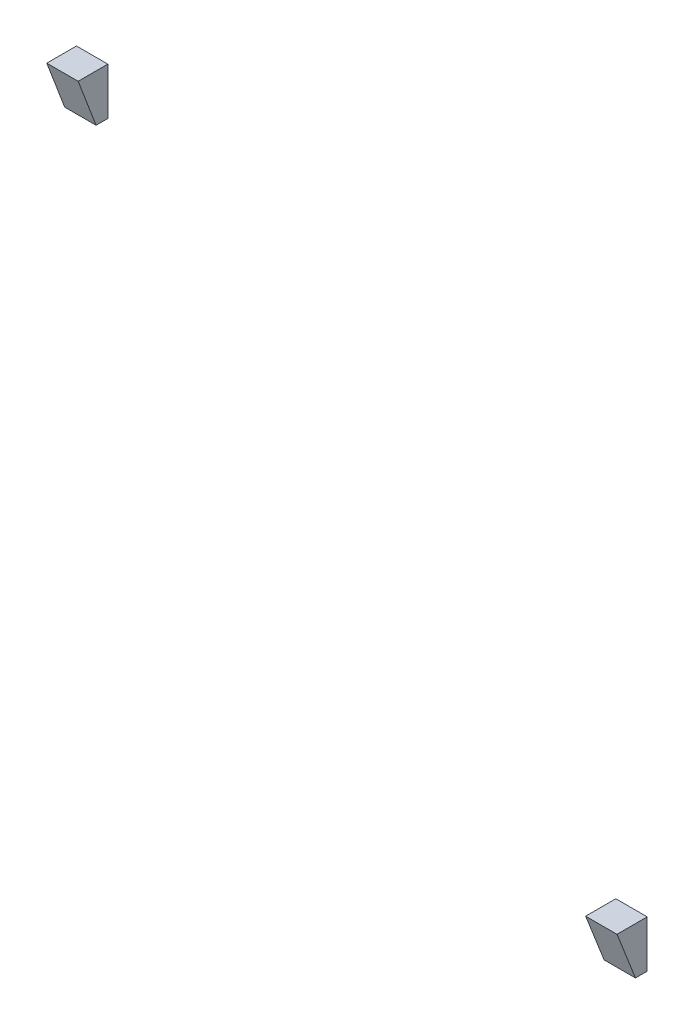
ISO-10303-21;
HEADER;
FILE_DESCRIPTION(('STEP AP214'),'2;1');
FILE_NAME('part.step','',(''),(''),'','','');
FILE_SCHEMA(('AUTOMOTIVE_DESIGN { 1 0 10303 214 1 1 1 1 }'));
ENDSEC;
DATA;
#1=APPLICATION_CONTEXT('core data for automotive mechanical design processes');
#2=APPLICATION_PROTOCOL_DEFINITION('international standard','automotive_design',2000,#1);
#3=PRODUCT_CONTEXT('',#1,'mechanical');
#4=PRODUCT('Part','Part','',(#3));
#5=PRODUCT_RELATED_PRODUCT_CATEGORY('part','',(#4));
#6=PRODUCT_DEFINITION_FORMATION('','',#4);
#7=PRODUCT_DEFINITION_CONTEXT('part definition',#1,'design');
#8=PRODUCT_DEFINITION('design','',#6,#7);
#9=PRODUCT_DEFINITION_SHAPE('','',#8);
#10=(LENGTH_UNIT() NAMED_UNIT(*) SI_UNIT(.MILLI.,.METRE.));
#11=(NAMED_UNIT(*) PLANE_ANGLE_UNIT() SI_UNIT($,.RADIAN.));
#12=(NAMED_UNIT(*) SI_UNIT($,.STERADIAN.) SOLID_ANGLE_UNIT());
#13=UNCERTAINTY_MEASURE_WITH_UNIT(LENGTH_MEASURE(1.E-05),#10,'distance_accuracy_value','');
#14=(GEOMETRIC_REPRESENTATION_CONTEXT(3) GLOBAL_UNCERTAINTY_ASSIGNED_CONTEXT((#13)) GLOBAL_UNIT_ASSIGNED_CONTEXT((#10,
#11,#12)) REPRESENTATION_CONTEXT('',''));
#15=CARTESIAN_POINT('',(0.,0.,0.));
#16=DIRECTION('',(0.,0.,1.));
#17=DIRECTION('',(1.,0.,0.));
#18=AXIS2_PLACEMENT_3D('',#15,#16,#17);
#19=CARTESIAN_POINT('',(32.7499999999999,-25.,5.));
#20=DIRECTION('',(0.,-1.,0.));
#21=DIRECTION('',(0.,0.,-1.));
#22=AXIS2_PLACEMENT_3D('',#19,#20,#21);
#23=PLANE('',#22);
#24=DIRECTION('',(-1.,0.,0.));
#25=VECTOR('',#24,1.);
#26=CARTESIAN_POINT('',(250.420855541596,-25.,3.84962931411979));
#27=LINE('',#26,#25);
#28=CARTESIAN_POINT('',(36.7499999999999,-25.,3.84962931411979));
#29=VERTEX_POINT('',#28);
#30=CARTESIAN_POINT('',(32.7499999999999,-25.,3.84962931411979));
#31=VERTEX_POINT('',#30);
#32=EDGE_CURVE('E95',#29,#31,#27,.T.);
#33=ORIENTED_EDGE('',*,*,#32,.F.);
#34=DIRECTION('',(0.,0.,-1.));
#35=VECTOR('',#34,1.);
#36=CARTESIAN_POINT('',(36.7499999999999,-25.,5.));
#37=LINE('',#36,#35);
#38=CARTESIAN_POINT('',(36.7499999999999,-25.,0.));
#39=VERTEX_POINT('',#38);
#40=EDGE_CURVE('E112',#29,#39,#37,.T.);
#41=ORIENTED_EDGE('',*,*,#40,.T.);
#42=DIRECTION('',(-1.,0.,0.));
#43=VECTOR('',#42,1.);
#44=CARTESIAN_POINT('',(32.7499999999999,-25.,0.));
#45=LINE('',#44,#43);
#46=CARTESIAN_POINT('',(32.7499999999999,-25.,0.));
#47=VERTEX_POINT('',#46);
#48=EDGE_CURVE('E121',#39,#47,#45,.T.);
#49=ORIENTED_EDGE('',*,*,#48,.T.);
#50=DIRECTION('',(0.,0.,-1.));
#51=VECTOR('',#50,1.);
#52=CARTESIAN_POINT('',(32.7499999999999,-25.,5.));
#53=LINE('',#52,#51);
#54=EDGE_CURVE('E118',#31,#47,#53,.T.);
#55=ORIENTED_EDGE('',*,*,#54,.F.);
#56=EDGE_LOOP('',(#33,#41,#49,#55));
#57=FACE_BOUND('',#56,.T.);
#58=ADVANCED_FACE('F52',(#57),#23,.F.);
#59=CARTESIAN_POINT('',(32.7499999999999,-25.,5.));
#60=DIRECTION('',(1.,0.,0.));
#61=DIRECTION('',(0.,0.,-1.));
#62=AXIS2_PLACEMENT_3D('',#59,#60,#61);
#63=PLANE('',#62);
#64=DIRECTION('',(0.,0.,-1.));
#65=VECTOR('',#64,1.);
#66=CARTESIAN_POINT('',(32.7499999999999,-31.,5.));
#67=LINE('',#66,#65);
#68=CARTESIAN_POINT('',(32.7499999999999,-31.,1.5));
#69=VERTEX_POINT('',#68);
#70=CARTESIAN_POINT('',(32.7499999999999,-31.,0.));
#71=VERTEX_POINT('',#70);
#72=EDGE_CURVE('E74',#69,#71,#67,.T.);
#73=ORIENTED_EDGE('',*,*,#72,.F.);
#74=DIRECTION('',(0.,0.931147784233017,0.364642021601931));
#75=VECTOR('',#74,1.);
#76=CARTESIAN_POINT('',(32.7499999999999,-24.6094081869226,4.00258697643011));
#77=LINE('',#76,#75);
#78=EDGE_CURVE('E92',#69,#31,#77,.T.);
#79=ORIENTED_EDGE('',*,*,#78,.T.);
#80=ORIENTED_EDGE('',*,*,#54,.T.);
#81=DIRECTION('',(0.,-1.,0.));
#82=VECTOR('',#81,1.);
#83=CARTESIAN_POINT('',(32.7499999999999,-25.,0.));
#84=LINE('',#83,#82);
#85=EDGE_CURVE('E61',#47,#71,#84,.T.);
#86=ORIENTED_EDGE('',*,*,#85,.T.);
#87=EDGE_LOOP('',(#73,#79,#80,#86));
#88=FACE_BOUND('',#87,.T.);
#89=ADVANCED_FACE('F106',(#88),#63,.F.);
#90=CARTESIAN_POINT('',(32.7499999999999,-31.,5.));
#91=DIRECTION('',(0.,1.,0.));
#92=DIRECTION('',(0.,0.,1.));
#93=AXIS2_PLACEMENT_3D('',#90,#91,#92);
#94=PLANE('',#93);
#95=DIRECTION('',(0.,0.,-1.));
#96=VECTOR('',#95,1.);
#97=CARTESIAN_POINT('',(36.7499999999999,-31.,5.));
#98=LINE('',#97,#96);
#99=CARTESIAN_POINT('',(36.7499999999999,-31.,1.5));
#100=VERTEX_POINT('',#99);
#101=CARTESIAN_POINT('',(36.7499999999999,-31.,0.));
#102=VERTEX_POINT('',#101);
#103=EDGE_CURVE('E102',#100,#102,#98,.T.);
#104=ORIENTED_EDGE('',*,*,#103,.F.);
#105=DIRECTION('',(-1.,0.,0.));
#106=VECTOR('',#105,1.);
#107=CARTESIAN_POINT('',(250.420855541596,-31.,1.5));
#108=LINE('',#107,#106);
#109=EDGE_CURVE('E68',#100,#69,#108,.T.);
#110=ORIENTED_EDGE('',*,*,#109,.T.);
#111=ORIENTED_EDGE('',*,*,#72,.T.);
#112=DIRECTION('',(1.,0.,0.));
#113=VECTOR('',#112,1.);
#114=CARTESIAN_POINT('',(32.7499999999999,-31.,0.));
#115=LINE('',#114,#113);
#116=EDGE_CURVE('E129',#71,#102,#115,.T.);
#117=ORIENTED_EDGE('',*,*,#116,.T.);
#118=EDGE_LOOP('',(#104,#110,#111,#117));
#119=FACE_BOUND('',#118,.T.);
#120=ADVANCED_FACE('F101',(#119),#94,.F.);
#121=CARTESIAN_POINT('',(36.7499999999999,-25.,5.));
#122=DIRECTION('',(-1.,0.,0.));
#123=DIRECTION('',(0.,0.,1.));
#124=AXIS2_PLACEMENT_3D('',#121,#122,#123);
#125=PLANE('',#124);
#126=ORIENTED_EDGE('',*,*,#40,.F.);
#127=DIRECTION('',(0.,-0.931147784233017,-0.364642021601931));
#128=VECTOR('',#127,1.);
#129=CARTESIAN_POINT('',(36.7499999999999,-24.6094081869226,4.00258697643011));
#130=LINE('',#129,#128);
#131=EDGE_CURVE('E12',#29,#100,#130,.T.);
#132=ORIENTED_EDGE('',*,*,#131,.T.);
#133=ORIENTED_EDGE('',*,*,#103,.T.);
#134=DIRECTION('',(0.,1.,0.));
#135=VECTOR('',#134,1.);
#136=CARTESIAN_POINT('',(36.7499999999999,-25.,0.));
#137=LINE('',#136,#135);
#138=EDGE_CURVE('E125',#102,#39,#137,.T.);
#139=ORIENTED_EDGE('',*,*,#138,.T.);
#140=EDGE_LOOP('',(#126,#132,#133,#139));
#141=FACE_BOUND('',#140,.T.);
#142=ADVANCED_FACE('F145',(#141),#125,.F.);
#143=CARTESIAN_POINT('',(0.,0.,0.));
#144=DIRECTION('',(0.,0.,1.));
#145=DIRECTION('',(1.,0.,0.));
#146=AXIS2_PLACEMENT_3D('',#143,#144,#145);
#147=PLANE('',#146);
#148=ORIENTED_EDGE('',*,*,#85,.F.);
#149=ORIENTED_EDGE('',*,*,#48,.F.);
#150=ORIENTED_EDGE('',*,*,#138,.F.);
#151=ORIENTED_EDGE('',*,*,#116,.F.);
#152=EDGE_LOOP('',(#148,#149,#150,#151));
#153=FACE_BOUND('',#152,.T.);
#154=ADVANCED_FACE('F54',(#153),#147,.F.);
#155=CARTESIAN_POINT('',(250.420855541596,-25.,3.84962931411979));
#156=DIRECTION('',(0.,0.364642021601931,-0.931147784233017));
#157=DIRECTION('',(0.,0.931147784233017,0.364642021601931));
#158=AXIS2_PLACEMENT_3D('',#155,#156,#157);
#159=PLANE('',#158);
#160=ORIENTED_EDGE('',*,*,#78,.F.);
#161=ORIENTED_EDGE('',*,*,#109,.F.);
#162=ORIENTED_EDGE('',*,*,#131,.F.);
#163=ORIENTED_EDGE('',*,*,#32,.T.);
#164=EDGE_LOOP('',(#160,#161,#162,#163));
#165=FACE_BOUND('',#164,.T.);
#166=ADVANCED_FACE('F93',(#165),#159,.F.);
#167=CLOSED_SHELL('',(#58,#89,#120,#142,#154,#166));
#168=MANIFOLD_SOLID_BREP('B2',#167);
#169=CARTESIAN_POINT('',(-36.,28.75,5.));
#170=DIRECTION('',(0.,1.,0.));
#171=DIRECTION('',(0.,0.,1.));
#172=AXIS2_PLACEMENT_3D('',#169,#170,#171);
#173=PLANE('',#172);
#174=DIRECTION('',(1.,0.,0.));
#175=VECTOR('',#174,1.);
#176=CARTESIAN_POINT('',(-244.670855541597,28.75,1.5));
#177=LINE('',#176,#175);
#178=CARTESIAN_POINT('',(-36.,28.75,1.5));
#179=VERTEX_POINT('',#178);
#180=CARTESIAN_POINT('',(-32.,28.75,1.5));
#181=VERTEX_POINT('',#180);
#182=EDGE_CURVE('E228',#179,#181,#177,.T.);
#183=ORIENTED_EDGE('',*,*,#182,.F.);
#184=DIRECTION('',(0.,0.,-1.));
#185=VECTOR('',#184,1.);
#186=CARTESIAN_POINT('',(-36.,28.75,5.));
#187=LINE('',#186,#185);
#188=CARTESIAN_POINT('',(-36.,28.75,0.));
#189=VERTEX_POINT('',#188);
#190=EDGE_CURVE('E221',#179,#189,#187,.T.);
#191=ORIENTED_EDGE('',*,*,#190,.T.);
#192=DIRECTION('',(1.,0.,0.));
#193=VECTOR('',#192,1.);
#194=CARTESIAN_POINT('',(-36.,28.75,0.));
#195=LINE('',#194,#193);
#196=CARTESIAN_POINT('',(-32.,28.75,0.));
#197=VERTEX_POINT('',#196);
#198=EDGE_CURVE('E287',#189,#197,#195,.T.);
#199=ORIENTED_EDGE('',*,*,#198,.T.);
#200=DIRECTION('',(0.,0.,-1.));
#201=VECTOR('',#200,1.);
#202=CARTESIAN_POINT('',(-32.,28.75,5.));
#203=LINE('',#202,#201);
#204=EDGE_CURVE('E274',#181,#197,#203,.T.);
#205=ORIENTED_EDGE('',*,*,#204,.F.);
#206=EDGE_LOOP('',(#183,#191,#199,#205));
#207=FACE_BOUND('',#206,.T.);
#208=ADVANCED_FACE('F212',(#207),#173,.F.);
#209=CARTESIAN_POINT('',(-36.,34.75,5.));
#210=DIRECTION('',(1.,0.,0.));
#211=DIRECTION('',(0.,0.,-1.));
#212=AXIS2_PLACEMENT_3D('',#209,#210,#211);
#213=PLANE('',#212);
#214=ORIENTED_EDGE('',*,*,#190,.F.);
#215=DIRECTION('',(0.,0.934668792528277,0.355519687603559));
#216=VECTOR('',#215,1.);
#217=CARTESIAN_POINT('',(-36.,35.1546605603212,3.93613881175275));
#218=LINE('',#217,#216);
#219=CARTESIAN_POINT('',(-36.,34.75,3.78221819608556));
#220=VERTEX_POINT('',#219);
#221=EDGE_CURVE('E255',#179,#220,#218,.T.);
#222=ORIENTED_EDGE('',*,*,#221,.T.);
#223=DIRECTION('',(0.,0.,-1.));
#224=VECTOR('',#223,1.);
#225=CARTESIAN_POINT('',(-36.,34.75,5.));
#226=LINE('',#225,#224);
#227=CARTESIAN_POINT('',(-36.,34.75,0.));
#228=VERTEX_POINT('',#227);
#229=EDGE_CURVE('E235',#220,#228,#226,.T.);
#230=ORIENTED_EDGE('',*,*,#229,.T.);
#231=DIRECTION('',(0.,-1.,0.));
#232=VECTOR('',#231,1.);
#233=CARTESIAN_POINT('',(-36.,34.75,0.));
#234=LINE('',#233,#232);
#235=EDGE_CURVE('E262',#228,#189,#234,.T.);
#236=ORIENTED_EDGE('',*,*,#235,.T.);
#237=EDGE_LOOP('',(#214,#222,#230,#236));
#238=FACE_BOUND('',#237,.T.);
#239=ADVANCED_FACE('F214',(#238),#213,.F.);
#240=CARTESIAN_POINT('',(-32.,34.75,5.));
#241=DIRECTION('',(-1.,0.,0.));
#242=DIRECTION('',(0.,0.,1.));
#243=AXIS2_PLACEMENT_3D('',#240,#241,#242);
#244=PLANE('',#243);
#245=DIRECTION('',(0.,0.,-1.));
#246=VECTOR('',#245,1.);
#247=CARTESIAN_POINT('',(-32.,34.75,5.));
#248=LINE('',#247,#246);
#249=CARTESIAN_POINT('',(-32.,34.75,3.78221819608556));
#250=VERTEX_POINT('',#249);
#251=CARTESIAN_POINT('',(-32.,34.75,0.));
#252=VERTEX_POINT('',#251);
#253=EDGE_CURVE('E269',#250,#252,#248,.T.);
#254=ORIENTED_EDGE('',*,*,#253,.F.);
#255=DIRECTION('',(0.,-0.934668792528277,-0.355519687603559));
#256=VECTOR('',#255,1.);
#257=CARTESIAN_POINT('',(-32.,35.1546605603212,3.93613881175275));
#258=LINE('',#257,#256);
#259=EDGE_CURVE('E50',#250,#181,#258,.T.);
#260=ORIENTED_EDGE('',*,*,#259,.T.);
#261=ORIENTED_EDGE('',*,*,#204,.T.);
#262=DIRECTION('',(0.,1.,0.));
#263=VECTOR('',#262,1.);
#264=CARTESIAN_POINT('',(-32.,34.75,0.));
#265=LINE('',#264,#263);
#266=EDGE_CURVE('E276',#197,#252,#265,.T.);
#267=ORIENTED_EDGE('',*,*,#266,.T.);
#268=EDGE_LOOP('',(#254,#260,#261,#267));
#269=FACE_BOUND('',#268,.T.);
#270=ADVANCED_FACE('F301',(#269),#244,.F.);
#271=CARTESIAN_POINT('',(-36.,34.75,5.));
#272=DIRECTION('',(0.,-1.,0.));
#273=DIRECTION('',(0.,0.,-1.));
#274=AXIS2_PLACEMENT_3D('',#271,#272,#273);
#275=PLANE('',#274);
#276=ORIENTED_EDGE('',*,*,#229,.F.);
#277=DIRECTION('',(1.,0.,0.));
#278=VECTOR('',#277,1.);
#279=CARTESIAN_POINT('',(-244.670855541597,34.75,3.78221819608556));
#280=LINE('',#279,#278);
#281=EDGE_CURVE('E253',#220,#250,#280,.T.);
#282=ORIENTED_EDGE('',*,*,#281,.T.);
#283=ORIENTED_EDGE('',*,*,#253,.T.);
#284=DIRECTION('',(-1.,0.,0.));
#285=VECTOR('',#284,1.);
#286=CARTESIAN_POINT('',(-36.,34.75,0.));
#287=LINE('',#286,#285);
#288=EDGE_CURVE('E266',#252,#228,#287,.T.);
#289=ORIENTED_EDGE('',*,*,#288,.T.);
#290=EDGE_LOOP('',(#276,#282,#283,#289));
#291=FACE_BOUND('',#290,.T.);
#292=ADVANCED_FACE('F264',(#291),#275,.F.);
#293=CARTESIAN_POINT('',(0.,0.,0.));
#294=DIRECTION('',(0.,0.,1.));
#295=DIRECTION('',(1.,0.,0.));
#296=AXIS2_PLACEMENT_3D('',#293,#294,#295);
#297=PLANE('',#296);
#298=ORIENTED_EDGE('',*,*,#235,.F.);
#299=ORIENTED_EDGE('',*,*,#288,.F.);
#300=ORIENTED_EDGE('',*,*,#266,.F.);
#301=ORIENTED_EDGE('',*,*,#198,.F.);
#302=EDGE_LOOP('',(#298,#299,#300,#301));
#303=FACE_BOUND('',#302,.T.);
#304=ADVANCED_FACE('F290',(#303),#297,.F.);
#305=CARTESIAN_POINT('',(-244.670855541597,28.75,1.5));
#306=DIRECTION('',(0.,0.355519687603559,-0.934668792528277));
#307=DIRECTION('',(0.,0.934668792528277,0.355519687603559));
#308=AXIS2_PLACEMENT_3D('',#305,#306,#307);
#309=PLANE('',#308);
#310=ORIENTED_EDGE('',*,*,#221,.F.);
#311=ORIENTED_EDGE('',*,*,#182,.T.);
#312=ORIENTED_EDGE('',*,*,#259,.F.);
#313=ORIENTED_EDGE('',*,*,#281,.F.);
#314=EDGE_LOOP('',(#310,#311,#312,#313));
#315=FACE_BOUND('',#314,.T.);
#316=ADVANCED_FACE('F254',(#315),#309,.F.);
#317=CLOSED_SHELL('',(#208,#239,#270,#292,#304,#316));
#318=MANIFOLD_SOLID_BREP('B6_NOT_SHOWN',#317);
#319=ADVANCED_BREP_SHAPE_REPRESENTATION('',(#18,#168,#318),#14);
#320=SHAPE_DEFINITION_REPRESENTATION(#9,#319);
ENDSEC;
END-ISO-10303-21;
